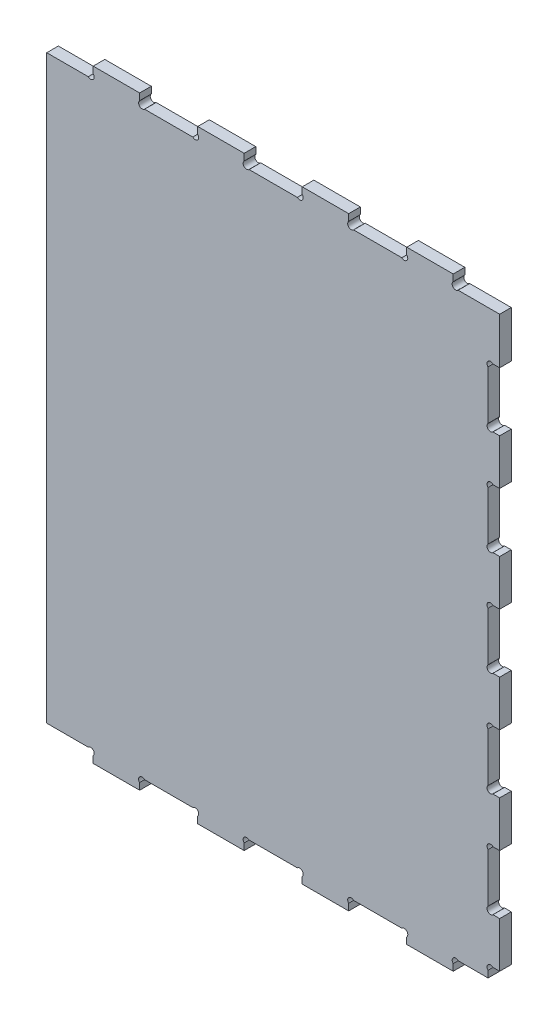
from build123d import *

# Parameters (mm, degrees)
CROQUIS1_W                 = 390
CROQUIS1_H                 = 500
SALIENTE_EXTRUIR1_DEPTH    = 10
CROQUIS2_W                 = 40
CROQUIS2_H                 = 10
SALIENTE_EXTRUIR2_DEPTH    = 10
CROQUIS3_R                 = 3
CORTAR_EXTRUIR1_DEPTH      = 643.105910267
MATRIZL1_COUNT             = 4
MATRIZL1_PITCH             = 90
SIMETR_A1_COPY_1_SKETCH_W  = 40
SIMETR_A1_COPY_1_SKETCH_H  = 10
SIMETR_A1_COPY_1_DEPTH     = 10
SIMETR_A1_COPY_2_SKETCH_W  = 40
SIMETR_A1_COPY_2_SKETCH_H  = 10
SIMETR_A1_COPY_2_DEPTH     = 10
SIMETR_A1_COPY_3_SKETCH_W  = 40
SIMETR_A1_COPY_3_SKETCH_H  = 10
SIMETR_A1_COPY_3_DEPTH     = 10
SIMETR_A1_COPY_4_SKETCH_R  = 3
SIMETR_A1_COPY_4_DEPTH     = 643.105910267
SIMETR_A1_COPY_5_SKETCH_R  = 3
SIMETR_A1_COPY_5_DEPTH     = 643.105910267
SIMETR_A1_COPY_6_SKETCH_R  = 3
SIMETR_A1_COPY_6_DEPTH     = 643.105910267
CROQUIS4_W                 = 10
CROQUIS4_H                 = 50.677675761
CORTAR_EXTRUIR2_DEPTH      = 643.105910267
CROQUIS5_R                 = 3
CORTAR_EXTRUIR3_DEPTH      = 643.105910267
MATRIZL2_COUNT             = 5
MATRIZL2_PITCH             = 90
CORTAR_EXTRUIR4_DEPTH      = 643.105910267
CORTAR_EXTRUIR4_DEPTH_BACK = 643.105910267


with BuildPart() as part:
    # Croquis1 → Saliente-Extruir1 (new body)
    with BuildSketch(Plane.XY):
        with Locations((-195, 250)):
            Rectangle(CROQUIS1_W, CROQUIS1_H)
    extrude(amount=-SALIENTE_EXTRUIR1_DEPTH)

    # Croquis2 → Saliente-Extruir2 (add)
    with BuildSketch(Plane(origin=(0, 500, 0), x_dir=(1, 0, 0), z_dir=(0, 1, 0))):
        with Locations((-60, 5)):
            Rectangle(CROQUIS2_W, CROQUIS2_H)
    saliente_extruir2 = extrude(amount=SALIENTE_EXTRUIR2_DEPTH)

    # Croquis3 → Cortar-Extruir1 (cut, symmetric)
    with BuildSketch(Plane.XY):
        with Locations((-37.878679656, 502.121320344)):
            Circle(CROQUIS3_R)
        with Locations((-82.121320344, 502.121320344)):
            Circle(CROQUIS3_R)
    cortar_extruir1 = extrude(amount=CORTAR_EXTRUIR1_DEPTH, both=True, mode=Mode.SUBTRACT)

    # MatrizL1: Saliente-Extruir2, Cortar-Extruir1 ×4
    with Locations(*[(-i * MATRIZL1_PITCH, 0, 0) for i in range(1, MATRIZL1_COUNT)]):
        add(saliente_extruir2)
        add(cortar_extruir1, mode=Mode.SUBTRACT)

    # Simetr_a1: Saliente-Extruir2, Cortar-Extruir1 across plane
    add(saliente_extruir2.mirror(Plane.ZX.offset(250)))
    add(cortar_extruir1.mirror(Plane.ZX.offset(250)), mode=Mode.SUBTRACT)

    # Simetr_a1 copy 1 sketch → Simetr_a1 copy 1 (add)
    with BuildSketch(Plane(origin=(-90, 0, 0), x_dir=(1, 0, 0), z_dir=(0, -1, 0))):
        with Locations((-60, -5)):
            Rectangle(SIMETR_A1_COPY_1_SKETCH_W, SIMETR_A1_COPY_1_SKETCH_H)
    extrude(amount=SIMETR_A1_COPY_1_DEPTH)

    # Simetr_a1 copy 2 sketch → Simetr_a1 copy 2 (add)
    with BuildSketch(Plane(origin=(-180, 0, 0), x_dir=(1, 0, 0), z_dir=(0, -1, 0))):
        with Locations((-60, -5)):
            Rectangle(SIMETR_A1_COPY_2_SKETCH_W, SIMETR_A1_COPY_2_SKETCH_H)
    extrude(amount=SIMETR_A1_COPY_2_DEPTH)

    # Simetr_a1 copy 3 sketch → Simetr_a1 copy 3 (add)
    with BuildSketch(Plane(origin=(-270, 0, 0), x_dir=(1, 0, 0), z_dir=(0, -1, 0))):
        with Locations((-60, -5)):
            Rectangle(SIMETR_A1_COPY_3_SKETCH_W, SIMETR_A1_COPY_3_SKETCH_H)
    extrude(amount=SIMETR_A1_COPY_3_DEPTH)

    # Simetr_a1 copy 4 sketch → Simetr_a1 copy 4 (cut, symmetric)
    with BuildSketch(Plane(origin=(-90, 500, 0), x_dir=(1, 0, 0), z_dir=(0, 0, 1))):
        with Locations((-37.878679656, -502.121320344)):
            Circle(SIMETR_A1_COPY_4_SKETCH_R)
        with Locations((-82.121320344, -502.121320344)):
            Circle(SIMETR_A1_COPY_4_SKETCH_R)
    extrude(amount=SIMETR_A1_COPY_4_DEPTH, both=True, mode=Mode.SUBTRACT)

    # Simetr_a1 copy 5 sketch → Simetr_a1 copy 5 (cut, symmetric)
    with BuildSketch(Plane(origin=(-180, 500, 0), x_dir=(1, 0, 0), z_dir=(0, 0, 1))):
        with Locations((-37.878679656, -502.121320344)):
            Circle(SIMETR_A1_COPY_5_SKETCH_R)
        with Locations((-82.121320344, -502.121320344)):
            Circle(SIMETR_A1_COPY_5_SKETCH_R)
    extrude(amount=SIMETR_A1_COPY_5_DEPTH, both=True, mode=Mode.SUBTRACT)

    # Simetr_a1 copy 6 sketch → Simetr_a1 copy 6 (cut, symmetric)
    with BuildSketch(Plane(origin=(-270, 500, 0), x_dir=(1, 0, 0), z_dir=(0, 0, 1))):
        with Locations((-37.878679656, -502.121320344)):
            Circle(SIMETR_A1_COPY_6_SKETCH_R)
        with Locations((-82.121320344, -502.121320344)):
            Circle(SIMETR_A1_COPY_6_SKETCH_R)
    extrude(amount=SIMETR_A1_COPY_6_DEPTH, both=True, mode=Mode.SUBTRACT)

    # Croquis4 → Cortar-Extruir2 (cut, through all)
    with BuildSketch(Plane.XY):
        with Locations((-5, 434.66116212)):
            Rectangle(CROQUIS4_W, CROQUIS4_H)
    cortar_extruir2 = extrude(amount=-CORTAR_EXTRUIR2_DEPTH, mode=Mode.SUBTRACT)

    # Croquis5 → Cortar-Extruir3 (cut, symmetric)
    with BuildSketch(Plane(origin=(0, 0, -10), x_dir=(-1, 0, 0), z_dir=(0, 0, -1))):
        with Locations((7.878679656, 457.878679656)):
            Circle(CROQUIS5_R)
        with Locations((7.878679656, 411.443644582)):
            Circle(CROQUIS5_R)
    cortar_extruir3 = extrude(amount=CORTAR_EXTRUIR3_DEPTH, both=True, mode=Mode.SUBTRACT)

    # MatrizL2: Cortar-Extruir2, Cortar-Extruir3 ×5
    with Locations(*[(0, -i * MATRIZL2_PITCH, 0) for i in range(1, MATRIZL2_COUNT)]):
        add(cortar_extruir2, mode=Mode.SUBTRACT)
        add(cortar_extruir3, mode=Mode.SUBTRACT)

    # Croquis6 → Cortar-Extruir4 (cut, two sides: drawn at the far end of the back side and taken through both)
    with BuildSketch(Plane(origin=(0, 0, -10), x_dir=(-1, 0, 0), z_dir=(0, 0, -1)).offset(-CORTAR_EXTRUIR4_DEPTH_BACK)):
        with BuildLine():
            Line((0, 0), (10, 0))
            Line((10, 0), (10, 5.759683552))
            ThreePointArc((10, 5.759683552), (10, 10.002324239), (5.757359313, 10.002324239))
            Line((5.757359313, 10.002324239), (0, 10.002324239))
            Line((0, 10.002324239), (0, 0))
        make_face()
    extrude(amount=CORTAR_EXTRUIR4_DEPTH + CORTAR_EXTRUIR4_DEPTH_BACK, mode=Mode.SUBTRACT)


solid = part.part
